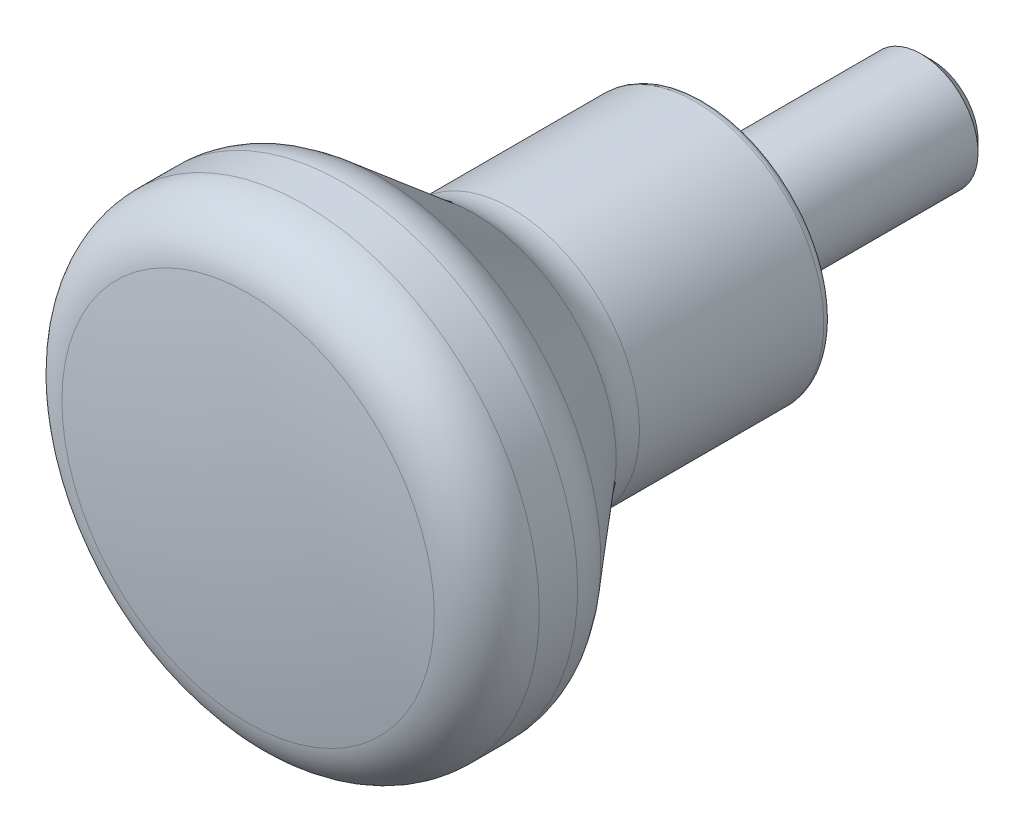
ISO-10303-21;
HEADER;
FILE_DESCRIPTION(('STEP AP214'),'2;1');
FILE_NAME('part.step','',(''),(''),'','','');
FILE_SCHEMA(('AUTOMOTIVE_DESIGN { 1 0 10303 214 1 1 1 1 }'));
ENDSEC;
DATA;
#1=APPLICATION_CONTEXT('core data for automotive mechanical design processes');
#2=APPLICATION_PROTOCOL_DEFINITION('international standard','automotive_design',2000,#1);
#3=PRODUCT_CONTEXT('',#1,'mechanical');
#4=PRODUCT('Part','Part','',(#3));
#5=PRODUCT_RELATED_PRODUCT_CATEGORY('part','',(#4));
#6=PRODUCT_DEFINITION_FORMATION('','',#4);
#7=PRODUCT_DEFINITION_CONTEXT('part definition',#1,'design');
#8=PRODUCT_DEFINITION('design','',#6,#7);
#9=PRODUCT_DEFINITION_SHAPE('','',#8);
#10=(LENGTH_UNIT() NAMED_UNIT(*) SI_UNIT(.MILLI.,.METRE.));
#11=(NAMED_UNIT(*) PLANE_ANGLE_UNIT() SI_UNIT($,.RADIAN.));
#12=(NAMED_UNIT(*) SI_UNIT($,.STERADIAN.) SOLID_ANGLE_UNIT());
#13=UNCERTAINTY_MEASURE_WITH_UNIT(LENGTH_MEASURE(1.E-05),#10,'distance_accuracy_value','');
#14=(GEOMETRIC_REPRESENTATION_CONTEXT(3) GLOBAL_UNCERTAINTY_ASSIGNED_CONTEXT((#13)) GLOBAL_UNIT_ASSIGNED_CONTEXT((#10,
#11,#12)) REPRESENTATION_CONTEXT('',''));
#15=CARTESIAN_POINT('',(0.,0.,0.));
#16=DIRECTION('',(0.,0.,1.));
#17=DIRECTION('',(1.,0.,0.));
#18=AXIS2_PLACEMENT_3D('',#15,#16,#17);
#19=CARTESIAN_POINT('',(-2.87096735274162E-13,0.,-57.0000000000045));
#20=DIRECTION('',(0.,0.,-1.));
#21=DIRECTION('',(1.,0.,0.));
#22=AXIS2_PLACEMENT_3D('',#19,#20,#21);
#23=SPHERICAL_SURFACE('',#22,90.0000000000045);
#24=CARTESIAN_POINT('',(0.,0.,32.0442423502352));
#25=DIRECTION('',(0.,0.,-1.));
#26=DIRECTION('',(0.,1.,0.));
#27=AXIS2_PLACEMENT_3D('',#24,#25,#26);
#28=CIRCLE('',#27,13.0813953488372);
#29=CARTESIAN_POINT('',(0.,13.0813953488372,32.0442423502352));
#30=VERTEX_POINT('',#29);
#31=EDGE_CURVE('E18',#30,#30,#28,.T.);
#32=ORIENTED_EDGE('',*,*,#31,.F.);
#33=EDGE_LOOP('',(#32));
#34=FACE_BOUND('',#33,.T.);
#35=ADVANCED_FACE('F12',(#34),#23,.T.);
#36=CARTESIAN_POINT('',(0.,0.,28.0867204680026));
#37=DIRECTION('',(0.,0.,-1.));
#38=DIRECTION('',(0.,1.,0.));
#39=AXIS2_PLACEMENT_3D('',#36,#37,#38);
#40=TOROIDAL_SURFACE('',#39,12.5,4.);
#41=ORIENTED_EDGE('',*,*,#31,.T.);
#42=EDGE_LOOP('',(#41));
#43=FACE_BOUND('',#42,.T.);
#44=CARTESIAN_POINT('',(0.,0.,28.0867204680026));
#45=DIRECTION('',(0.,0.,-1.));
#46=DIRECTION('',(0.,1.,0.));
#47=AXIS2_PLACEMENT_3D('',#44,#45,#46);
#48=CIRCLE('',#47,16.5);
#49=CARTESIAN_POINT('',(0.,16.5,28.0867204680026));
#50=VERTEX_POINT('',#49);
#51=EDGE_CURVE('E22',#50,#50,#48,.T.);
#52=ORIENTED_EDGE('',*,*,#51,.F.);
#53=EDGE_LOOP('',(#52));
#54=FACE_BOUND('',#53,.T.);
#55=ADVANCED_FACE('F69',(#43,#54),#40,.T.);
#56=CARTESIAN_POINT('',(0.,0.,0.));
#57=DIRECTION('',(0.,0.,-1.));
#58=DIRECTION('',(0.,1.,0.));
#59=AXIS2_PLACEMENT_3D('',#56,#57,#58);
#60=CYLINDRICAL_SURFACE('',#59,16.5);
#61=CARTESIAN_POINT('',(0.,0.,25.3940328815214));
#62=DIRECTION('',(0.,0.,-1.));
#63=DIRECTION('',(0.,1.,0.));
#64=AXIS2_PLACEMENT_3D('',#61,#62,#63);
#65=CIRCLE('',#64,16.5);
#66=CARTESIAN_POINT('',(0.,16.5,25.3940328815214));
#67=VERTEX_POINT('',#66);
#68=EDGE_CURVE('E26',#67,#67,#65,.T.);
#69=ORIENTED_EDGE('',*,*,#68,.F.);
#70=EDGE_LOOP('',(#69));
#71=FACE_BOUND('',#70,.T.);
#72=ORIENTED_EDGE('',*,*,#51,.T.);
#73=EDGE_LOOP('',(#72));
#74=FACE_BOUND('',#73,.T.);
#75=ADVANCED_FACE('F74',(#71,#74),#60,.T.);
#76=CARTESIAN_POINT('',(0.,0.,25.3940328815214));
#77=DIRECTION('',(0.,0.,-1.));
#78=DIRECTION('',(0.,1.,0.));
#79=AXIS2_PLACEMENT_3D('',#76,#77,#78);
#80=TOROIDAL_SURFACE('',#79,12.5,4.);
#81=ORIENTED_EDGE('',*,*,#68,.T.);
#82=EDGE_LOOP('',(#81));
#83=FACE_BOUND('',#82,.T.);
#84=CARTESIAN_POINT('',(0.,0.,22.8228824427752));
#85=DIRECTION('',(0.,0.,-1.));
#86=DIRECTION('',(0.,1.,0.));
#87=AXIS2_PLACEMENT_3D('',#84,#85,#86);
#88=CIRCLE('',#87,15.5641777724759);
#89=CARTESIAN_POINT('',(0.,15.5641777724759,22.8228824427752));
#90=VERTEX_POINT('',#89);
#91=EDGE_CURVE('E31',#90,#90,#88,.T.);
#92=ORIENTED_EDGE('',*,*,#91,.F.);
#93=EDGE_LOOP('',(#92));
#94=FACE_BOUND('',#93,.T.);
#95=ADVANCED_FACE('F78',(#83,#94),#80,.T.);
#96=CARTESIAN_POINT('',(0.,0.,22.8228824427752));
#97=DIRECTION('',(0.,0.,1.));
#98=DIRECTION('',(0.,-1.,0.));
#99=AXIS2_PLACEMENT_3D('',#96,#97,#98);
#100=CONICAL_SURFACE('',#99,15.5641777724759,0.698131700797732);
#101=CARTESIAN_POINT('',(0.,0.,16.1152695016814));
#102=DIRECTION('',(0.,0.,-1.));
#103=DIRECTION('',(0.,1.,0.));
#104=AXIS2_PLACEMENT_3D('',#101,#102,#103);
#105=CIRCLE('',#104,9.93582222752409);
#106=CARTESIAN_POINT('',(0.,9.93582222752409,16.1152695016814));
#107=VERTEX_POINT('',#106);
#108=EDGE_CURVE('E34',#107,#107,#105,.T.);
#109=ORIENTED_EDGE('',*,*,#108,.F.);
#110=EDGE_LOOP('',(#109));
#111=FACE_BOUND('',#110,.T.);
#112=ORIENTED_EDGE('',*,*,#91,.T.);
#113=EDGE_LOOP('',(#112));
#114=FACE_BOUND('',#113,.T.);
#115=ADVANCED_FACE('F85',(#111,#114),#100,.T.);
#116=CARTESIAN_POINT('',(0.,0.,13.5441190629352));
#117=DIRECTION('',(0.,0.,-1.));
#118=DIRECTION('',(0.,1.,0.));
#119=AXIS2_PLACEMENT_3D('',#116,#117,#118);
#120=TOROIDAL_SURFACE('',#119,13.,4.);
#121=CARTESIAN_POINT('',(0.,0.,13.5441190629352));
#122=DIRECTION('',(0.,0.,-1.));
#123=DIRECTION('',(0.,1.,0.));
#124=AXIS2_PLACEMENT_3D('',#121,#122,#123);
#125=CIRCLE('',#124,9.);
#126=CARTESIAN_POINT('',(0.,9.,13.5441190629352));
#127=VERTEX_POINT('',#126);
#128=EDGE_CURVE('E37',#127,#127,#125,.T.);
#129=ORIENTED_EDGE('',*,*,#128,.F.);
#130=EDGE_LOOP('',(#129));
#131=FACE_BOUND('',#130,.T.);
#132=ORIENTED_EDGE('',*,*,#108,.T.);
#133=EDGE_LOOP('',(#132));
#134=FACE_BOUND('',#133,.T.);
#135=ADVANCED_FACE('F89',(#131,#134),#120,.F.);
#136=CARTESIAN_POINT('',(0.,0.,0.));
#137=DIRECTION('',(0.,0.,-1.));
#138=DIRECTION('',(0.,1.,0.));
#139=AXIS2_PLACEMENT_3D('',#136,#137,#138);
#140=CYLINDRICAL_SURFACE('',#139,9.);
#141=CARTESIAN_POINT('',(0.,0.,0.6));
#142=DIRECTION('',(0.,0.,-1.));
#143=DIRECTION('',(0.,1.,0.));
#144=AXIS2_PLACEMENT_3D('',#141,#142,#143);
#145=CIRCLE('',#144,9.);
#146=CARTESIAN_POINT('',(0.,9.,0.6));
#147=VERTEX_POINT('',#146);
#148=EDGE_CURVE('E40',#147,#147,#145,.T.);
#149=ORIENTED_EDGE('',*,*,#148,.F.);
#150=EDGE_LOOP('',(#149));
#151=FACE_BOUND('',#150,.T.);
#152=ORIENTED_EDGE('',*,*,#128,.T.);
#153=EDGE_LOOP('',(#152));
#154=FACE_BOUND('',#153,.T.);
#155=ADVANCED_FACE('F93',(#151,#154),#140,.T.);
#156=CARTESIAN_POINT('',(0.,0.,0.6));
#157=DIRECTION('',(0.,0.,-1.));
#158=DIRECTION('',(0.,1.,0.));
#159=AXIS2_PLACEMENT_3D('',#156,#157,#158);
#160=TOROIDAL_SURFACE('',#159,8.4,0.6);
#161=ORIENTED_EDGE('',*,*,#148,.T.);
#162=EDGE_LOOP('',(#161));
#163=FACE_BOUND('',#162,.T.);
#164=CARTESIAN_POINT('',(0.,0.,0.));
#165=DIRECTION('',(0.,0.,-1.));
#166=DIRECTION('',(0.,1.,0.));
#167=AXIS2_PLACEMENT_3D('',#164,#165,#166);
#168=CIRCLE('',#167,8.4);
#169=CARTESIAN_POINT('',(0.,8.4,0.));
#170=VERTEX_POINT('',#169);
#171=EDGE_CURVE('E43',#170,#170,#168,.T.);
#172=ORIENTED_EDGE('',*,*,#171,.F.);
#173=EDGE_LOOP('',(#172));
#174=FACE_BOUND('',#173,.T.);
#175=ADVANCED_FACE('F97',(#163,#174),#160,.T.);
#176=CARTESIAN_POINT('',(8.4,0.,0.));
#177=DIRECTION('',(0.,0.,1.));
#178=DIRECTION('',(0.,-1.,0.));
#179=AXIS2_PLACEMENT_3D('',#176,#177,#178);
#180=PLANE('',#179);
#181=CARTESIAN_POINT('',(0.,0.,0.));
#182=DIRECTION('',(0.,0.,1.));
#183=DIRECTION('',(0.,-1.,0.));
#184=AXIS2_PLACEMENT_3D('',#181,#182,#183);
#185=CIRCLE('',#184,4.);
#186=CARTESIAN_POINT('',(0.,-4.,0.));
#187=VERTEX_POINT('',#186);
#188=EDGE_CURVE('E8',#187,#187,#185,.F.);
#189=ORIENTED_EDGE('',*,*,#188,.F.);
#190=EDGE_LOOP('',(#189));
#191=FACE_BOUND('',#190,.T.);
#192=ORIENTED_EDGE('',*,*,#171,.T.);
#193=EDGE_LOOP('',(#192));
#194=FACE_BOUND('',#193,.T.);
#195=ADVANCED_FACE('F100',(#191,#194),#180,.F.);
#196=CARTESIAN_POINT('',(3.233,0.,-16.));
#197=DIRECTION('',(0.,0.,1.));
#198=DIRECTION('',(0.,-1.,0.));
#199=AXIS2_PLACEMENT_3D('',#196,#197,#198);
#200=PLANE('',#199);
#201=CARTESIAN_POINT('',(0.,0.,-16.));
#202=DIRECTION('',(0.,0.,-1.));
#203=DIRECTION('',(0.,1.,0.));
#204=AXIS2_PLACEMENT_3D('',#201,#202,#203);
#205=CIRCLE('',#204,3.233);
#206=CARTESIAN_POINT('',(0.,3.233,-16.));
#207=VERTEX_POINT('',#206);
#208=EDGE_CURVE('E49',#207,#207,#205,.T.);
#209=ORIENTED_EDGE('',*,*,#208,.T.);
#210=EDGE_LOOP('',(#209));
#211=FACE_BOUND('',#210,.T.);
#212=ADVANCED_FACE('F53',(#211),#200,.F.);
#213=CARTESIAN_POINT('',(0.,0.,-15.233));
#214=DIRECTION('',(0.,0.,1.));
#215=DIRECTION('',(0.,-1.,0.));
#216=AXIS2_PLACEMENT_3D('',#213,#214,#215);
#217=CONICAL_SURFACE('',#216,4.,0.785398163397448);
#218=ORIENTED_EDGE('',*,*,#208,.F.);
#219=EDGE_LOOP('',(#218));
#220=FACE_BOUND('',#219,.T.);
#221=CARTESIAN_POINT('',(0.,0.,-15.233));
#222=DIRECTION('',(0.,0.,-1.));
#223=DIRECTION('',(0.,1.,0.));
#224=AXIS2_PLACEMENT_3D('',#221,#222,#223);
#225=CIRCLE('',#224,4.);
#226=CARTESIAN_POINT('',(0.,4.,-15.233));
#227=VERTEX_POINT('',#226);
#228=EDGE_CURVE('E46',#227,#227,#225,.T.);
#229=ORIENTED_EDGE('',*,*,#228,.T.);
#230=EDGE_LOOP('',(#229));
#231=FACE_BOUND('',#230,.T.);
#232=ADVANCED_FACE('F55',(#220,#231),#217,.T.);
#233=CARTESIAN_POINT('',(0.,0.,-16.));
#234=DIRECTION('',(0.,0.,-1.));
#235=DIRECTION('',(0.,1.,0.));
#236=AXIS2_PLACEMENT_3D('',#233,#234,#235);
#237=CYLINDRICAL_SURFACE('',#236,4.);
#238=ORIENTED_EDGE('',*,*,#228,.F.);
#239=EDGE_LOOP('',(#238));
#240=FACE_BOUND('',#239,.T.);
#241=ORIENTED_EDGE('',*,*,#188,.T.);
#242=EDGE_LOOP('',(#241));
#243=FACE_BOUND('',#242,.T.);
#244=ADVANCED_FACE('F58',(#240,#243),#237,.T.);
#245=CLOSED_SHELL('',(#35,#55,#75,#95,#115,#135,#155,#175,#195,#212,#232,#244));
#246=MANIFOLD_SOLID_BREP('B1',#245);
#247=ADVANCED_BREP_SHAPE_REPRESENTATION('',(#18,#246),#14);
#248=SHAPE_DEFINITION_REPRESENTATION(#9,#247);
ENDSEC;
END-ISO-10303-21;
